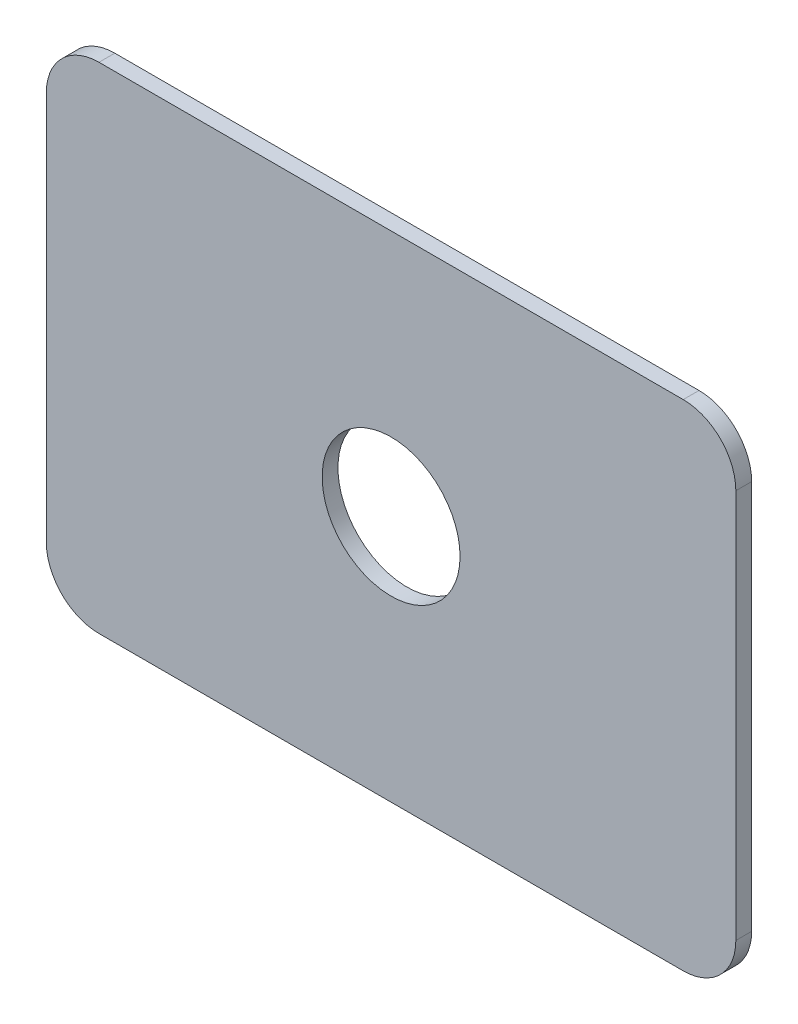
ISO-10303-21;
HEADER;
FILE_DESCRIPTION(('STEP AP214'),'2;1');
FILE_NAME('part.step','',(''),(''),'','','');
FILE_SCHEMA(('AUTOMOTIVE_DESIGN { 1 0 10303 214 1 1 1 1 }'));
ENDSEC;
DATA;
#1=APPLICATION_CONTEXT('core data for automotive mechanical design processes');
#2=APPLICATION_PROTOCOL_DEFINITION('international standard','automotive_design',2000,#1);
#3=PRODUCT_CONTEXT('',#1,'mechanical');
#4=PRODUCT('Part','Part','',(#3));
#5=PRODUCT_RELATED_PRODUCT_CATEGORY('part','',(#4));
#6=PRODUCT_DEFINITION_FORMATION('','',#4);
#7=PRODUCT_DEFINITION_CONTEXT('part definition',#1,'design');
#8=PRODUCT_DEFINITION('design','',#6,#7);
#9=PRODUCT_DEFINITION_SHAPE('','',#8);
#10=(LENGTH_UNIT() NAMED_UNIT(*) SI_UNIT(.MILLI.,.METRE.));
#11=(NAMED_UNIT(*) PLANE_ANGLE_UNIT() SI_UNIT($,.RADIAN.));
#12=(NAMED_UNIT(*) SI_UNIT($,.STERADIAN.) SOLID_ANGLE_UNIT());
#13=UNCERTAINTY_MEASURE_WITH_UNIT(LENGTH_MEASURE(1.E-05),#10,'distance_accuracy_value','');
#14=(GEOMETRIC_REPRESENTATION_CONTEXT(3) GLOBAL_UNCERTAINTY_ASSIGNED_CONTEXT((#13)) GLOBAL_UNIT_ASSIGNED_CONTEXT((#10,
#11,#12)) REPRESENTATION_CONTEXT('',''));
#15=CARTESIAN_POINT('',(0.,0.,0.));
#16=DIRECTION('',(0.,0.,1.));
#17=DIRECTION('',(1.,0.,0.));
#18=AXIS2_PLACEMENT_3D('',#15,#16,#17);
#19=CARTESIAN_POINT('',(-111.,74.,6.));
#20=DIRECTION('',(0.,0.,-1.));
#21=DIRECTION('',(-1.,0.,0.));
#22=AXIS2_PLACEMENT_3D('',#19,#20,#21);
#23=CYLINDRICAL_SURFACE('',#22,20.);
#24=CARTESIAN_POINT('',(-111.,74.,0.));
#25=DIRECTION('',(0.,0.,1.));
#26=DIRECTION('',(1.,0.,0.));
#27=AXIS2_PLACEMENT_3D('',#24,#25,#26);
#28=CIRCLE('',#27,20.);
#29=CARTESIAN_POINT('',(-111.,94.,0.));
#30=VERTEX_POINT('',#29);
#31=CARTESIAN_POINT('',(-131.,73.9999999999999,0.));
#32=VERTEX_POINT('',#31);
#33=EDGE_CURVE('E100',#30,#32,#28,.T.);
#34=ORIENTED_EDGE('',*,*,#33,.T.);
#35=DIRECTION('',(0.,0.,-1.));
#36=VECTOR('',#35,1.);
#37=CARTESIAN_POINT('',(-131.,73.9999999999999,6.));
#38=LINE('',#37,#36);
#39=CARTESIAN_POINT('',(-131.,73.9999999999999,6.));
#40=VERTEX_POINT('',#39);
#41=EDGE_CURVE('E11',#40,#32,#38,.T.);
#42=ORIENTED_EDGE('',*,*,#41,.F.);
#43=CARTESIAN_POINT('',(-111.,74.,6.));
#44=DIRECTION('',(0.,0.,1.));
#45=DIRECTION('',(1.,0.,0.));
#46=AXIS2_PLACEMENT_3D('',#43,#44,#45);
#47=CIRCLE('',#46,20.);
#48=CARTESIAN_POINT('',(-111.,94.,6.));
#49=VERTEX_POINT('',#48);
#50=EDGE_CURVE('E130',#49,#40,#47,.T.);
#51=ORIENTED_EDGE('',*,*,#50,.F.);
#52=DIRECTION('',(0.,0.,-1.));
#53=VECTOR('',#52,1.);
#54=CARTESIAN_POINT('',(-111.,94.,6.));
#55=LINE('',#54,#53);
#56=EDGE_CURVE('E113',#49,#30,#55,.T.);
#57=ORIENTED_EDGE('',*,*,#56,.T.);
#58=EDGE_LOOP('',(#34,#42,#51,#57));
#59=FACE_BOUND('',#58,.T.);
#60=ADVANCED_FACE('F31',(#59),#23,.T.);
#61=CARTESIAN_POINT('',(-131.,73.9999999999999,6.));
#62=DIRECTION('',(1.,0.,0.));
#63=DIRECTION('',(0.,1.,0.));
#64=AXIS2_PLACEMENT_3D('',#61,#62,#63);
#65=PLANE('',#64);
#66=DIRECTION('',(0.,-1.,0.));
#67=VECTOR('',#66,1.);
#68=CARTESIAN_POINT('',(-131.,73.9999999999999,0.));
#69=LINE('',#68,#67);
#70=CARTESIAN_POINT('',(-131.,-73.9999999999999,0.));
#71=VERTEX_POINT('',#70);
#72=EDGE_CURVE('E96',#32,#71,#69,.T.);
#73=ORIENTED_EDGE('',*,*,#72,.T.);
#74=DIRECTION('',(0.,0.,-1.));
#75=VECTOR('',#74,1.);
#76=CARTESIAN_POINT('',(-131.,-73.9999999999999,6.));
#77=LINE('',#76,#75);
#78=CARTESIAN_POINT('',(-131.,-73.9999999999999,6.));
#79=VERTEX_POINT('',#78);
#80=EDGE_CURVE('E39',#79,#71,#77,.T.);
#81=ORIENTED_EDGE('',*,*,#80,.F.);
#82=DIRECTION('',(0.,-1.,0.));
#83=VECTOR('',#82,1.);
#84=CARTESIAN_POINT('',(-131.,73.9999999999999,6.));
#85=LINE('',#84,#83);
#86=EDGE_CURVE('E109',#40,#79,#85,.T.);
#87=ORIENTED_EDGE('',*,*,#86,.F.);
#88=ORIENTED_EDGE('',*,*,#41,.T.);
#89=EDGE_LOOP('',(#73,#81,#87,#88));
#90=FACE_BOUND('',#89,.T.);
#91=ADVANCED_FACE('F108',(#90),#65,.F.);
#92=CARTESIAN_POINT('',(-111.,-74.,6.));
#93=DIRECTION('',(0.,0.,-1.));
#94=DIRECTION('',(-1.,0.,0.));
#95=AXIS2_PLACEMENT_3D('',#92,#93,#94);
#96=CYLINDRICAL_SURFACE('',#95,20.);
#97=CARTESIAN_POINT('',(-111.,-74.,0.));
#98=DIRECTION('',(0.,0.,1.));
#99=DIRECTION('',(1.,0.,0.));
#100=AXIS2_PLACEMENT_3D('',#97,#98,#99);
#101=CIRCLE('',#100,20.);
#102=CARTESIAN_POINT('',(-111.,-94.,0.));
#103=VERTEX_POINT('',#102);
#104=EDGE_CURVE('E102',#71,#103,#101,.T.);
#105=ORIENTED_EDGE('',*,*,#104,.T.);
#106=DIRECTION('',(0.,0.,-1.));
#107=VECTOR('',#106,1.);
#108=CARTESIAN_POINT('',(-111.,-94.,6.));
#109=LINE('',#108,#107);
#110=CARTESIAN_POINT('',(-111.,-94.,6.));
#111=VERTEX_POINT('',#110);
#112=EDGE_CURVE('E156',#111,#103,#109,.T.);
#113=ORIENTED_EDGE('',*,*,#112,.F.);
#114=CARTESIAN_POINT('',(-111.,-74.,6.));
#115=DIRECTION('',(0.,0.,1.));
#116=DIRECTION('',(1.,0.,0.));
#117=AXIS2_PLACEMENT_3D('',#114,#115,#116);
#118=CIRCLE('',#117,20.);
#119=EDGE_CURVE('E133',#79,#111,#118,.T.);
#120=ORIENTED_EDGE('',*,*,#119,.F.);
#121=ORIENTED_EDGE('',*,*,#80,.T.);
#122=EDGE_LOOP('',(#105,#113,#120,#121));
#123=FACE_BOUND('',#122,.T.);
#124=ADVANCED_FACE('F161',(#123),#96,.T.);
#125=CARTESIAN_POINT('',(-111.,-94.,6.));
#126=DIRECTION('',(0.,1.,0.));
#127=DIRECTION('',(0.,0.,1.));
#128=AXIS2_PLACEMENT_3D('',#125,#126,#127);
#129=PLANE('',#128);
#130=DIRECTION('',(1.,0.,0.));
#131=VECTOR('',#130,1.);
#132=CARTESIAN_POINT('',(-111.,-94.,0.));
#133=LINE('',#132,#131);
#134=CARTESIAN_POINT('',(111.,-94.,0.));
#135=VERTEX_POINT('',#134);
#136=EDGE_CURVE('E120',#103,#135,#133,.T.);
#137=ORIENTED_EDGE('',*,*,#136,.T.);
#138=DIRECTION('',(0.,0.,-1.));
#139=VECTOR('',#138,1.);
#140=CARTESIAN_POINT('',(111.,-94.,6.));
#141=LINE('',#140,#139);
#142=CARTESIAN_POINT('',(111.,-94.,6.));
#143=VERTEX_POINT('',#142);
#144=EDGE_CURVE('E153',#143,#135,#141,.T.);
#145=ORIENTED_EDGE('',*,*,#144,.F.);
#146=DIRECTION('',(1.,0.,0.));
#147=VECTOR('',#146,1.);
#148=CARTESIAN_POINT('',(-111.,-94.,6.));
#149=LINE('',#148,#147);
#150=EDGE_CURVE('E135',#111,#143,#149,.T.);
#151=ORIENTED_EDGE('',*,*,#150,.F.);
#152=ORIENTED_EDGE('',*,*,#112,.T.);
#153=EDGE_LOOP('',(#137,#145,#151,#152));
#154=FACE_BOUND('',#153,.T.);
#155=ADVANCED_FACE('F169',(#154),#129,.F.);
#156=CARTESIAN_POINT('',(111.,-74.,6.));
#157=DIRECTION('',(0.,0.,-1.));
#158=DIRECTION('',(-1.,0.,0.));
#159=AXIS2_PLACEMENT_3D('',#156,#157,#158);
#160=CYLINDRICAL_SURFACE('',#159,20.);
#161=CARTESIAN_POINT('',(111.,-74.,0.));
#162=DIRECTION('',(0.,0.,1.));
#163=DIRECTION('',(1.,0.,0.));
#164=AXIS2_PLACEMENT_3D('',#161,#162,#163);
#165=CIRCLE('',#164,20.);
#166=CARTESIAN_POINT('',(131.,-73.9999999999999,0.));
#167=VERTEX_POINT('',#166);
#168=EDGE_CURVE('E122',#135,#167,#165,.T.);
#169=ORIENTED_EDGE('',*,*,#168,.T.);
#170=DIRECTION('',(0.,0.,-1.));
#171=VECTOR('',#170,1.);
#172=CARTESIAN_POINT('',(131.,-73.9999999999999,6.));
#173=LINE('',#172,#171);
#174=CARTESIAN_POINT('',(131.,-73.9999999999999,6.));
#175=VERTEX_POINT('',#174);
#176=EDGE_CURVE('E150',#175,#167,#173,.T.);
#177=ORIENTED_EDGE('',*,*,#176,.F.);
#178=CARTESIAN_POINT('',(111.,-74.,6.));
#179=DIRECTION('',(0.,0.,1.));
#180=DIRECTION('',(1.,0.,0.));
#181=AXIS2_PLACEMENT_3D('',#178,#179,#180);
#182=CIRCLE('',#181,20.);
#183=EDGE_CURVE('E137',#143,#175,#182,.T.);
#184=ORIENTED_EDGE('',*,*,#183,.F.);
#185=ORIENTED_EDGE('',*,*,#144,.T.);
#186=EDGE_LOOP('',(#169,#177,#184,#185));
#187=FACE_BOUND('',#186,.T.);
#188=ADVANCED_FACE('F172',(#187),#160,.T.);
#189=CARTESIAN_POINT('',(131.,73.9999999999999,6.));
#190=DIRECTION('',(-1.,0.,0.));
#191=DIRECTION('',(0.,-1.,0.));
#192=AXIS2_PLACEMENT_3D('',#189,#190,#191);
#193=PLANE('',#192);
#194=DIRECTION('',(0.,1.,0.));
#195=VECTOR('',#194,1.);
#196=CARTESIAN_POINT('',(131.,73.9999999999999,0.));
#197=LINE('',#196,#195);
#198=CARTESIAN_POINT('',(131.,73.9999999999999,0.));
#199=VERTEX_POINT('',#198);
#200=EDGE_CURVE('E124',#167,#199,#197,.T.);
#201=ORIENTED_EDGE('',*,*,#200,.T.);
#202=DIRECTION('',(0.,0.,-1.));
#203=VECTOR('',#202,1.);
#204=CARTESIAN_POINT('',(131.,73.9999999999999,6.));
#205=LINE('',#204,#203);
#206=CARTESIAN_POINT('',(131.,73.9999999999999,6.));
#207=VERTEX_POINT('',#206);
#208=EDGE_CURVE('E147',#207,#199,#205,.T.);
#209=ORIENTED_EDGE('',*,*,#208,.F.);
#210=DIRECTION('',(0.,1.,0.));
#211=VECTOR('',#210,1.);
#212=CARTESIAN_POINT('',(131.,73.9999999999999,6.));
#213=LINE('',#212,#211);
#214=EDGE_CURVE('E139',#175,#207,#213,.T.);
#215=ORIENTED_EDGE('',*,*,#214,.F.);
#216=ORIENTED_EDGE('',*,*,#176,.T.);
#217=EDGE_LOOP('',(#201,#209,#215,#216));
#218=FACE_BOUND('',#217,.T.);
#219=ADVANCED_FACE('F177',(#218),#193,.F.);
#220=CARTESIAN_POINT('',(111.,74.,6.));
#221=DIRECTION('',(0.,0.,-1.));
#222=DIRECTION('',(-1.,0.,0.));
#223=AXIS2_PLACEMENT_3D('',#220,#221,#222);
#224=CYLINDRICAL_SURFACE('',#223,20.);
#225=CARTESIAN_POINT('',(111.,74.,0.));
#226=DIRECTION('',(0.,0.,1.));
#227=DIRECTION('',(-1.,0.,0.));
#228=AXIS2_PLACEMENT_3D('',#225,#226,#227);
#229=CIRCLE('',#228,20.);
#230=CARTESIAN_POINT('',(111.,94.,0.));
#231=VERTEX_POINT('',#230);
#232=EDGE_CURVE('E126',#199,#231,#229,.T.);
#233=ORIENTED_EDGE('',*,*,#232,.T.);
#234=DIRECTION('',(0.,0.,-1.));
#235=VECTOR('',#234,1.);
#236=CARTESIAN_POINT('',(111.,94.,6.));
#237=LINE('',#236,#235);
#238=CARTESIAN_POINT('',(111.,94.,6.));
#239=VERTEX_POINT('',#238);
#240=EDGE_CURVE('E144',#239,#231,#237,.T.);
#241=ORIENTED_EDGE('',*,*,#240,.F.);
#242=CARTESIAN_POINT('',(111.,74.,6.));
#243=DIRECTION('',(0.,0.,1.));
#244=DIRECTION('',(-1.,0.,0.));
#245=AXIS2_PLACEMENT_3D('',#242,#243,#244);
#246=CIRCLE('',#245,20.);
#247=EDGE_CURVE('E51',#207,#239,#246,.T.);
#248=ORIENTED_EDGE('',*,*,#247,.F.);
#249=ORIENTED_EDGE('',*,*,#208,.T.);
#250=EDGE_LOOP('',(#233,#241,#248,#249));
#251=FACE_BOUND('',#250,.T.);
#252=ADVANCED_FACE('F180',(#251),#224,.T.);
#253=CARTESIAN_POINT('',(-111.,94.,6.));
#254=DIRECTION('',(0.,-1.,0.));
#255=DIRECTION('',(0.,0.,-1.));
#256=AXIS2_PLACEMENT_3D('',#253,#254,#255);
#257=PLANE('',#256);
#258=DIRECTION('',(-1.,0.,0.));
#259=VECTOR('',#258,1.);
#260=CARTESIAN_POINT('',(-111.,94.,0.));
#261=LINE('',#260,#259);
#262=EDGE_CURVE('E128',#231,#30,#261,.T.);
#263=ORIENTED_EDGE('',*,*,#262,.T.);
#264=ORIENTED_EDGE('',*,*,#56,.F.);
#265=DIRECTION('',(-1.,0.,0.));
#266=VECTOR('',#265,1.);
#267=CARTESIAN_POINT('',(-111.,94.,6.));
#268=LINE('',#267,#266);
#269=EDGE_CURVE('E46',#239,#49,#268,.T.);
#270=ORIENTED_EDGE('',*,*,#269,.F.);
#271=ORIENTED_EDGE('',*,*,#240,.T.);
#272=EDGE_LOOP('',(#263,#264,#270,#271));
#273=FACE_BOUND('',#272,.T.);
#274=ADVANCED_FACE('F182',(#273),#257,.F.);
#275=CARTESIAN_POINT('',(-111.,74.,6.));
#276=DIRECTION('',(0.,0.,1.));
#277=DIRECTION('',(1.,0.,0.));
#278=AXIS2_PLACEMENT_3D('',#275,#276,#277);
#279=PLANE('',#278);
#280=CARTESIAN_POINT('',(0.,0.,6.));
#281=DIRECTION('',(0.,0.,1.));
#282=DIRECTION('',(1.,0.,0.));
#283=AXIS2_PLACEMENT_3D('',#280,#281,#282);
#284=CIRCLE('',#283,26.2);
#285=CARTESIAN_POINT('',(26.2,0.,6.));
#286=VERTEX_POINT('',#285);
#287=EDGE_CURVE('E116',#286,#286,#284,.T.);
#288=ORIENTED_EDGE('',*,*,#287,.F.);
#289=EDGE_LOOP('',(#288));
#290=FACE_BOUND('',#289,.T.);
#291=ORIENTED_EDGE('',*,*,#50,.T.);
#292=ORIENTED_EDGE('',*,*,#86,.T.);
#293=ORIENTED_EDGE('',*,*,#119,.T.);
#294=ORIENTED_EDGE('',*,*,#150,.T.);
#295=ORIENTED_EDGE('',*,*,#183,.T.);
#296=ORIENTED_EDGE('',*,*,#214,.T.);
#297=ORIENTED_EDGE('',*,*,#247,.T.);
#298=ORIENTED_EDGE('',*,*,#269,.T.);
#299=EDGE_LOOP('',(#291,#292,#293,#294,#295,#296,#297,#298));
#300=FACE_BOUND('',#299,.T.);
#301=ADVANCED_FACE('F164',(#290,#300),#279,.T.);
#302=CARTESIAN_POINT('',(-111.,74.,0.));
#303=DIRECTION('',(0.,0.,1.));
#304=DIRECTION('',(1.,0.,0.));
#305=AXIS2_PLACEMENT_3D('',#302,#303,#304);
#306=PLANE('',#305);
#307=CARTESIAN_POINT('',(0.,0.,0.));
#308=DIRECTION('',(0.,0.,1.));
#309=DIRECTION('',(1.,0.,0.));
#310=AXIS2_PLACEMENT_3D('',#307,#308,#309);
#311=CIRCLE('',#310,26.2);
#312=CARTESIAN_POINT('',(26.2,0.,0.));
#313=VERTEX_POINT('',#312);
#314=EDGE_CURVE('E34',#313,#313,#311,.T.);
#315=ORIENTED_EDGE('',*,*,#314,.T.);
#316=EDGE_LOOP('',(#315));
#317=FACE_BOUND('',#316,.T.);
#318=ORIENTED_EDGE('',*,*,#33,.F.);
#319=ORIENTED_EDGE('',*,*,#262,.F.);
#320=ORIENTED_EDGE('',*,*,#232,.F.);
#321=ORIENTED_EDGE('',*,*,#200,.F.);
#322=ORIENTED_EDGE('',*,*,#168,.F.);
#323=ORIENTED_EDGE('',*,*,#136,.F.);
#324=ORIENTED_EDGE('',*,*,#104,.F.);
#325=ORIENTED_EDGE('',*,*,#72,.F.);
#326=EDGE_LOOP('',(#318,#319,#320,#321,#322,#323,#324,#325));
#327=FACE_BOUND('',#326,.T.);
#328=ADVANCED_FACE('F97',(#317,#327),#306,.F.);
#329=CARTESIAN_POINT('',(0.,0.,-4.));
#330=DIRECTION('',(0.,0.,1.));
#331=DIRECTION('',(1.,0.,0.));
#332=AXIS2_PLACEMENT_3D('',#329,#330,#331);
#333=CYLINDRICAL_SURFACE('',#332,26.2);
#334=ORIENTED_EDGE('',*,*,#287,.T.);
#335=EDGE_LOOP('',(#334));
#336=FACE_BOUND('',#335,.T.);
#337=ORIENTED_EDGE('',*,*,#314,.F.);
#338=EDGE_LOOP('',(#337));
#339=FACE_BOUND('',#338,.T.);
#340=ADVANCED_FACE('F233',(#336,#339),#333,.F.);
#341=CLOSED_SHELL('',(#60,#91,#124,#155,#188,#219,#252,#274,#301,#328,#340));
#342=MANIFOLD_SOLID_BREP('B2',#341);
#343=ADVANCED_BREP_SHAPE_REPRESENTATION('',(#18,#342),#14);
#344=SHAPE_DEFINITION_REPRESENTATION(#9,#343);
ENDSEC;
END-ISO-10303-21;
